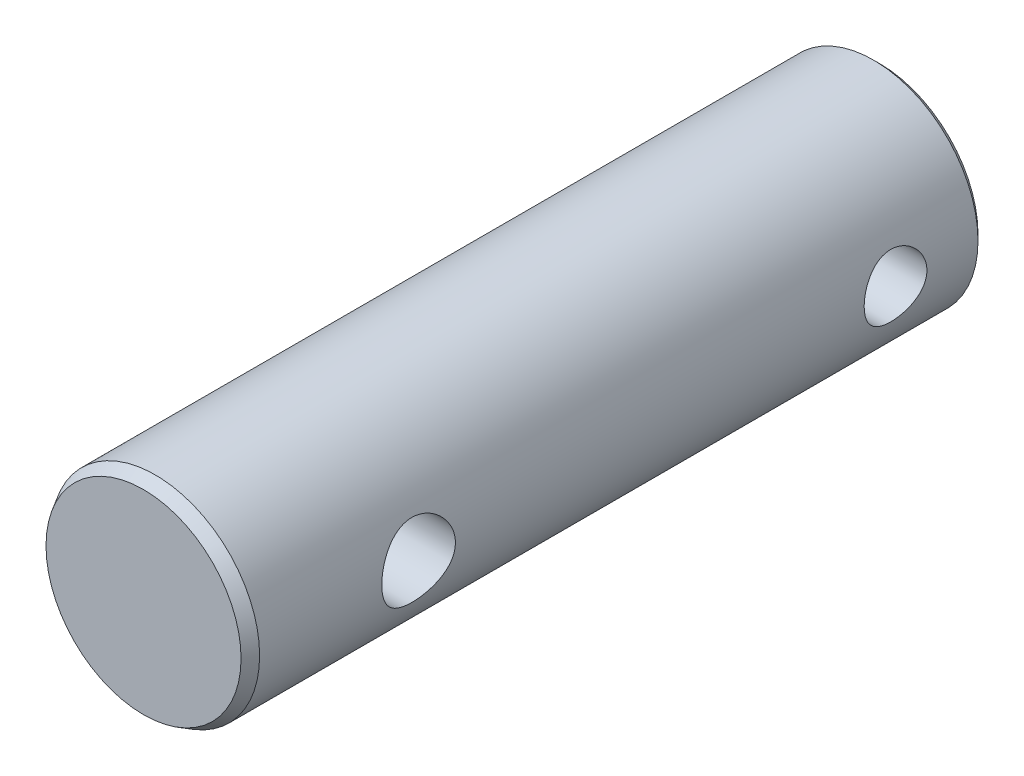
ISO-10303-21;
HEADER;
FILE_DESCRIPTION(('STEP AP214'),'2;1');
FILE_NAME('part.step','',(''),(''),'','','');
FILE_SCHEMA(('AUTOMOTIVE_DESIGN { 1 0 10303 214 1 1 1 1 }'));
ENDSEC;
DATA;
#1=APPLICATION_CONTEXT('core data for automotive mechanical design processes');
#2=APPLICATION_PROTOCOL_DEFINITION('international standard','automotive_design',2000,#1);
#3=PRODUCT_CONTEXT('',#1,'mechanical');
#4=PRODUCT('Part','Part','',(#3));
#5=PRODUCT_RELATED_PRODUCT_CATEGORY('part','',(#4));
#6=PRODUCT_DEFINITION_FORMATION('','',#4);
#7=PRODUCT_DEFINITION_CONTEXT('part definition',#1,'design');
#8=PRODUCT_DEFINITION('design','',#6,#7);
#9=PRODUCT_DEFINITION_SHAPE('','',#8);
#10=(LENGTH_UNIT() NAMED_UNIT(*) SI_UNIT(.MILLI.,.METRE.));
#11=(NAMED_UNIT(*) PLANE_ANGLE_UNIT() SI_UNIT($,.RADIAN.));
#12=(NAMED_UNIT(*) SI_UNIT($,.STERADIAN.) SOLID_ANGLE_UNIT());
#13=UNCERTAINTY_MEASURE_WITH_UNIT(LENGTH_MEASURE(1.E-05),#10,'distance_accuracy_value','');
#14=(GEOMETRIC_REPRESENTATION_CONTEXT(3) GLOBAL_UNCERTAINTY_ASSIGNED_CONTEXT((#13)) GLOBAL_UNIT_ASSIGNED_CONTEXT((#10,
#11,#12)) REPRESENTATION_CONTEXT('',''));
#15=CARTESIAN_POINT('',(0.,0.,0.));
#16=DIRECTION('',(0.,0.,1.));
#17=DIRECTION('',(1.,0.,0.));
#18=AXIS2_PLACEMENT_3D('',#15,#16,#17);
#19=CARTESIAN_POINT('',(0.,0.,15.2119852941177));
#20=DIRECTION('',(0.,0.,1.));
#21=DIRECTION('',(1.,0.,0.));
#22=AXIS2_PLACEMENT_3D('',#19,#20,#21);
#23=CYLINDRICAL_SURFACE('',#22,2.);
#24=CARTESIAN_POINT('',(0.,0.,0.254000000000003));
#25=DIRECTION('',(0.,0.,1.));
#26=DIRECTION('',(1.,0.,0.));
#27=AXIS2_PLACEMENT_3D('',#24,#25,#26);
#28=CIRCLE('',#27,2.);
#29=CARTESIAN_POINT('',(2.,0.,0.254000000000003));
#30=VERTEX_POINT('',#29);
#31=EDGE_CURVE('E114',#30,#30,#28,.F.);
#32=ORIENTED_EDGE('',*,*,#31,.T.);
#33=EDGE_LOOP('',(#32));
#34=FACE_BOUND('',#33,.T.);
#35=CARTESIAN_POINT('',(0.,0.,10.16));
#36=DIRECTION('',(0.,0.,1.));
#37=DIRECTION('',(1.,0.,0.));
#38=AXIS2_PLACEMENT_3D('',#35,#36,#37);
#39=CIRCLE('',#38,2.);
#40=CARTESIAN_POINT('',(2.,0.,10.16));
#41=VERTEX_POINT('',#40);
#42=EDGE_CURVE('E84',#41,#41,#39,.T.);
#43=ORIENTED_EDGE('',*,*,#42,.T.);
#44=EDGE_LOOP('',(#43));
#45=FACE_BOUND('',#44,.T.);
#46=CARTESIAN_POINT('',(2.,0.,2.45745));
#47=CARTESIAN_POINT('',(1.99999797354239,-0.067731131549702,2.45745209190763));
#48=CARTESIAN_POINT('',(1.99652812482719,-0.135481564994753,2.46256791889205));
#49=CARTESIAN_POINT('',(1.98298635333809,-0.268825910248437,2.48271686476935));
#50=CARTESIAN_POINT('',(1.97290933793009,-0.334418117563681,2.49775763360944));
#51=CARTESIAN_POINT('',(1.94714576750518,-0.461300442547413,2.53682208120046));
#52=CARTESIAN_POINT('',(1.93148661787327,-0.522609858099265,2.56080189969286));
#53=CARTESIAN_POINT('',(1.89580694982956,-0.64006978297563,2.61671123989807));
#54=CARTESIAN_POINT('',(1.87578598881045,-0.696219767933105,2.64864156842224));
#55=CARTESIAN_POINT('',(1.83092247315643,-0.807221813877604,2.72252317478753));
#56=CARTESIAN_POINT('',(1.80581342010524,-0.861547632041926,2.76509982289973));
#57=CARTESIAN_POINT('',(1.7539373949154,-0.96278078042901,2.85755396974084));
#58=CARTESIAN_POINT('',(1.72716804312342,-1.00967710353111,2.90744209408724));
#59=CARTESIAN_POINT('',(1.66968100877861,-1.10254490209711,3.02252515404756));
#60=CARTESIAN_POINT('',(1.63903102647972,-1.14711949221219,3.0888896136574));
#61=CARTESIAN_POINT('',(1.5820953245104,-1.22445066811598,3.22987210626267));
#62=CARTESIAN_POINT('',(1.55580212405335,-1.25722762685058,3.30447561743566));
#63=CARTESIAN_POINT('',(1.5187047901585,-1.30158113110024,3.4376533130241));
#64=CARTESIAN_POINT('',(1.50561956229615,-1.31656015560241,3.49445207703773));
#65=CARTESIAN_POINT('',(1.48564756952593,-1.33906047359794,3.61052838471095));
#66=CARTESIAN_POINT('',(1.47874981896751,-1.34659498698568,3.66980133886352));
#67=CARTESIAN_POINT('',(1.47222521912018,-1.35372839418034,3.78951358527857));
#68=CARTESIAN_POINT('',(1.47263145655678,-1.3532911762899,3.84995694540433));
#69=CARTESIAN_POINT('',(1.48072695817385,-1.34442527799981,3.96977274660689));
#70=CARTESIAN_POINT('',(1.48842152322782,-1.33599078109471,4.02914437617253));
#71=CARTESIAN_POINT('',(1.50931979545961,-1.31231970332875,4.1422408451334));
#72=CARTESIAN_POINT('',(1.52222822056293,-1.29744502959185,4.19609956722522));
#73=CARTESIAN_POINT('',(1.55202527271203,-1.26164962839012,4.30059909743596));
#74=CARTESIAN_POINT('',(1.56891696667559,-1.24072423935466,4.35123738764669));
#75=CARTESIAN_POINT('',(1.6139678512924,-1.18196930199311,4.47242680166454));
#76=CARTESIAN_POINT('',(1.64363714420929,-1.1408511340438,4.5408316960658));
#77=CARTESIAN_POINT('',(1.7045324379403,-1.04770100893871,4.66907571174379));
#78=CARTESIAN_POINT('',(1.7357612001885,-0.995649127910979,4.72889885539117));
#79=CARTESIAN_POINT('',(1.79673656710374,-0.880906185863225,4.8394610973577));
#80=CARTESIAN_POINT('',(1.82646898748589,-0.818131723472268,4.89012203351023));
#81=CARTESIAN_POINT('',(1.88110736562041,-0.683160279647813,4.98014204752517));
#82=CARTESIAN_POINT('',(1.90602322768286,-0.610983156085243,5.01952439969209));
#83=CARTESIAN_POINT('',(1.94358635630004,-0.475666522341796,5.07779136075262));
#84=CARTESIAN_POINT('',(1.95772852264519,-0.414063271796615,5.09928362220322));
#85=CARTESIAN_POINT('',(1.98028226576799,-0.287414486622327,5.13328120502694));
#86=CARTESIAN_POINT('',(1.9886976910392,-0.222371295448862,5.14579256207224));
#87=CARTESIAN_POINT('',(1.99905416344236,-0.0904148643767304,5.16116312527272));
#88=CARTESIAN_POINT('',(2.00097413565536,-0.0234962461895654,5.16399091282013));
#89=CARTESIAN_POINT('',(1.99809298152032,0.109880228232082,5.15972945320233));
#90=CARTESIAN_POINT('',(1.99329141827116,0.176338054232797,5.15263956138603));
#91=CARTESIAN_POINT('',(1.97783691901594,0.303401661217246,5.12958256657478));
#92=CARTESIAN_POINT('',(1.96749490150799,0.364133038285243,5.11408665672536));
#93=CARTESIAN_POINT('',(1.94199743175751,0.481957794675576,5.07528998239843));
#94=CARTESIAN_POINT('',(1.926841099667,0.539050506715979,5.05198779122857));
#95=CARTESIAN_POINT('',(1.89136310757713,0.653148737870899,4.99623222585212));
#96=CARTESIAN_POINT('',(1.87071922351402,0.709761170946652,4.96318398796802));
#97=CARTESIAN_POINT('',(1.82648464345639,0.816896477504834,4.88994888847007));
#98=CARTESIAN_POINT('',(1.80289163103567,0.867414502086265,4.8497564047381));
#99=CARTESIAN_POINT('',(1.75025015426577,0.969773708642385,4.7557965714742));
#100=CARTESIAN_POINT('',(1.72094756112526,1.02043373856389,4.70088322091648));
#101=CARTESIAN_POINT('',(1.66308093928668,1.11225262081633,4.58321260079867));
#102=CARTESIAN_POINT('',(1.63451718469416,1.15340799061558,4.5204524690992));
#103=CARTESIAN_POINT('',(1.58522226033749,1.22005355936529,4.39737974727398));
#104=CARTESIAN_POINT('',(1.56395644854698,1.24695396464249,4.33804917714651));
#105=CARTESIAN_POINT('',(1.52674356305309,1.292253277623,4.21468479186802));
#106=CARTESIAN_POINT('',(1.51078608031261,1.31066885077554,4.1506604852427));
#107=CARTESIAN_POINT('',(1.48857159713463,1.33581191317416,4.02953441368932));
#108=CARTESIAN_POINT('',(1.48118147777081,1.34392488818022,3.97293378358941));
#109=CARTESIAN_POINT('',(1.4730059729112,1.35288368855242,3.85870156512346));
#110=CARTESIAN_POINT('',(1.47221521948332,1.35373542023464,3.80107085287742));
#111=CARTESIAN_POINT('',(1.47735450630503,1.34812291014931,3.68653741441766));
#112=CARTESIAN_POINT('',(1.48327875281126,1.34166497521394,3.62963410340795));
#113=CARTESIAN_POINT('',(1.5009484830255,1.32186422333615,3.51794845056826));
#114=CARTESIAN_POINT('',(1.51270203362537,1.30851186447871,3.46316916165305));
#115=CARTESIAN_POINT('',(1.54513730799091,1.27018257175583,3.33937668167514));
#116=CARTESIAN_POINT('',(1.56748012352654,1.2428359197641,3.27153866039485));
#117=CARTESIAN_POINT('',(1.61642521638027,1.1784750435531,3.14230244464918));
#118=CARTESIAN_POINT('',(1.64303385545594,1.14144632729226,3.08091409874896));
#119=CARTESIAN_POINT('',(1.69813751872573,1.05777508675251,2.96396910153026));
#120=CARTESIAN_POINT('',(1.72665913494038,1.0109598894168,2.90854879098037));
#121=CARTESIAN_POINT('',(1.78258034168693,0.908737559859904,2.80558455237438));
#122=CARTESIAN_POINT('',(1.80997963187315,0.853328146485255,2.75804272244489));
#123=CARTESIAN_POINT('',(1.86435453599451,0.727596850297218,2.66689157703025));
#124=CARTESIAN_POINT('',(1.89091535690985,0.65629164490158,2.62437144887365));
#125=CARTESIAN_POINT('',(1.93673795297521,0.505203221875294,2.55257802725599));
#126=CARTESIAN_POINT('',(1.95601632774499,0.425439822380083,2.52327457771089));
#127=CARTESIAN_POINT('',(1.9800364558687,0.287464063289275,2.48710632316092));
#128=CARTESIAN_POINT('',(1.9874741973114,0.230797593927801,2.47603078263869));
#129=CARTESIAN_POINT('',(1.99745588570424,0.116091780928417,2.46120314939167));
#130=CARTESIAN_POINT('',(2.00000173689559,0.058052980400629,2.45744820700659));
#131=CARTESIAN_POINT('',(2.,0.,2.45745));
#132=B_SPLINE_CURVE_WITH_KNOTS('',3,(#46,#47,#48,#49,#50,#51,#52,#53,#54,#55,#56,#57,#58,#59,
#60,#61,#62,#63,#64,#65,#66,#67,#68,#69,#70,#71,#72,#73,#74,#75,#76,#77,#78,#79,#80,#81,#82,#83,
#84,#85,#86,#87,#88,#89,#90,#91,#92,#93,#94,#95,#96,#97,#98,#99,#100,#101,#102,#103,#104,#105,
#106,#107,#108,#109,#110,#111,#112,#113,#114,#115,#116,#117,#118,#119,#120,#121,#122,#123,#124,
#125,#126,#127,#128,#129,#130,#131),.UNSPECIFIED.,.T.,.F.,(4,2,2,2,2,2,2,2,2,2,2,2,2,2,2,2,2,2,
2,2,2,2,2,2,2,2,2,2,2,2,2,2,2,2,2,2,2,2,2,2,2,2,4),(0.,0.202956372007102,0.406069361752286,
0.608198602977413,0.810348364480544,1.02987075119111,1.24971538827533,1.50539669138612,
1.76063432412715,1.9404702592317,2.11998626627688,2.30031567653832,2.48077634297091,
2.65219706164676,2.82375019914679,3.07787145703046,3.33245986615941,3.58912705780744,
3.84526071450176,4.04469518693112,4.24399550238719,4.44394184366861,4.64390118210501,
4.83366229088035,5.02345809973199,5.22885817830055,5.43442061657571,5.67422225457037,
5.914111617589,6.11895348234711,6.32339127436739,6.49558028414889,6.66762922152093,
6.83952982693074,7.01166898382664,7.23987497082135,7.46842450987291,7.70141074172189,
7.93445892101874,8.19443606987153,8.45381699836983,8.62784054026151,8.80179632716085),.UNSPECIFIED.);
#133=CARTESIAN_POINT('',(2.,0.,2.45745));
#134=VERTEX_POINT('',#133);
#135=EDGE_CURVE('E77',#134,#134,#132,.T.);
#136=ORIENTED_EDGE('',*,*,#135,.F.);
#137=EDGE_LOOP('',(#136));
#138=FACE_BOUND('',#137,.T.);
#139=ADVANCED_FACE('F36',(#34,#45,#138),#23,.F.);
#140=CARTESIAN_POINT('',(0.,0.,15.2119852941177));
#141=DIRECTION('',(0.,0.,1.));
#142=DIRECTION('',(1.,0.,0.));
#143=AXIS2_PLACEMENT_3D('',#140,#141,#142);
#144=CYLINDRICAL_SURFACE('',#143,4.5);
#145=CARTESIAN_POINT('',(-4.5,0.,22.7965));
#146=CARTESIAN_POINT('',(-4.50000107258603,0.0863260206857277,22.7964984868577));
#147=CARTESIAN_POINT('',(-4.49749360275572,0.172641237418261,22.8035639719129));
#148=CARTESIAN_POINT('',(-4.48773934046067,0.342711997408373,22.831540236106));
#149=CARTESIAN_POINT('',(-4.48049260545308,0.42646757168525,22.8524508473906));
#150=CARTESIAN_POINT('',(-4.46204294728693,0.588942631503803,22.9072993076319));
#151=CARTESIAN_POINT('',(-4.45084710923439,0.667670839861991,22.9412138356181));
#152=CARTESIAN_POINT('',(-4.42562930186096,0.818319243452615,23.020995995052));
#153=CARTESIAN_POINT('',(-4.41160667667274,0.890237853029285,23.0668664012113));
#154=CARTESIAN_POINT('',(-4.3815987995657,1.02797575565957,23.1710960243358));
#155=CARTESIAN_POINT('',(-4.36556255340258,1.09349930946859,23.229831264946));
#156=CARTESIAN_POINT('',(-4.33360156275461,1.2139979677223,23.3573245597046));
#157=CARTESIAN_POINT('',(-4.31767684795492,1.26897035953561,23.4260851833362));
#158=CARTESIAN_POINT('',(-4.28716654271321,1.36858030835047,23.5744421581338));
#159=CARTESIAN_POINT('',(-4.27264223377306,1.41281842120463,23.6543205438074));
#160=CARTESIAN_POINT('',(-4.24736081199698,1.48710366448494,23.8209780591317));
#161=CARTESIAN_POINT('',(-4.23660239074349,1.51715572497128,23.9077547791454));
#162=CARTESIAN_POINT('',(-4.22061149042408,1.56107976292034,24.0823615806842));
#163=CARTESIAN_POINT('',(-4.21518874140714,1.57551085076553,24.1700330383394));
#164=CARTESIAN_POINT('',(-4.2099228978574,1.58953162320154,24.3467078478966));
#165=CARTESIAN_POINT('',(-4.21007782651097,1.58912656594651,24.4357107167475));
#166=CARTESIAN_POINT('',(-4.21578430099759,1.57391762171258,24.6076019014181));
#167=CARTESIAN_POINT('',(-4.22105486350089,1.55986340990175,24.6905675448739));
#168=CARTESIAN_POINT('',(-4.23593570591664,1.51898548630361,24.8528771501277));
#169=CARTESIAN_POINT('',(-4.2455465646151,1.49216007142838,24.9322206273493));
#170=CARTESIAN_POINT('',(-4.26821093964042,1.42604713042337,25.0866566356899));
#171=CARTESIAN_POINT('',(-4.28132162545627,1.38655022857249,25.1616507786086));
#172=CARTESIAN_POINT('',(-4.30948668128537,1.29636099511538,25.3041749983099));
#173=CARTESIAN_POINT('',(-4.32454166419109,1.24566512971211,25.3717027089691));
#174=CARTESIAN_POINT('',(-4.35598264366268,1.13099397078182,25.5015623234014));
#175=CARTESIAN_POINT('',(-4.37239479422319,1.06641216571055,25.5633535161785));
#176=CARTESIAN_POINT('',(-4.4039308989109,0.927605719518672,25.675378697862));
#177=CARTESIAN_POINT('',(-4.41905469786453,0.853379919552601,25.7256112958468));
#178=CARTESIAN_POINT('',(-4.4465521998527,0.696140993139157,25.8135998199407));
#179=CARTESIAN_POINT('',(-4.45888986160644,0.613031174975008,25.8511950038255));
#180=CARTESIAN_POINT('',(-4.47916106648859,0.441125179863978,25.9116972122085));
#181=CARTESIAN_POINT('',(-4.4870963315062,0.352331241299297,25.934609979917));
#182=CARTESIAN_POINT('',(-4.49737546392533,0.176142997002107,25.9641022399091));
#183=CARTESIAN_POINT('',(-4.49996883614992,0.0888852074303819,25.9714111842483));
#184=CARTESIAN_POINT('',(-4.5000305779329,-0.0856373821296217,25.971587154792));
#185=CARTESIAN_POINT('',(-4.49749993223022,-0.172902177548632,25.9644569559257));
#186=CARTESIAN_POINT('',(-4.48776289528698,-0.341937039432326,25.936524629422));
#187=CARTESIAN_POINT('',(-4.48071437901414,-0.423793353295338,25.9161838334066));
#188=CARTESIAN_POINT('',(-4.46280802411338,-0.582887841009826,25.8629983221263));
#189=CARTESIAN_POINT('',(-4.45194969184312,-0.660125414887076,25.8301519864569));
#190=CARTESIAN_POINT('',(-4.42713575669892,-0.810196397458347,25.7518814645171));
#191=CARTESIAN_POINT('',(-4.41310222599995,-0.882846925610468,25.7061320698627));
#192=CARTESIAN_POINT('',(-4.38351264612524,-1.01966898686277,25.6037290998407));
#193=CARTESIAN_POINT('',(-4.36795608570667,-1.08383765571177,25.5470718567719));
#194=CARTESIAN_POINT('',(-4.33605799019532,-1.20529955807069,25.42104056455));
#195=CARTESIAN_POINT('',(-4.31971701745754,-1.26207301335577,25.3511641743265));
#196=CARTESIAN_POINT('',(-4.2888891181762,-1.36316990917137,25.2025358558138));
#197=CARTESIAN_POINT('',(-4.27440226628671,-1.40749284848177,25.1237835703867));
#198=CARTESIAN_POINT('',(-4.24903422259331,-1.48232209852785,24.9593569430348));
#199=CARTESIAN_POINT('',(-4.23815452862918,-1.51282267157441,24.8736797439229));
#200=CARTESIAN_POINT('',(-4.22146446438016,-1.55879684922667,24.6979237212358));
#201=CARTESIAN_POINT('',(-4.21565143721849,-1.57427833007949,24.6078472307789));
#202=CARTESIAN_POINT('',(-4.21007865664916,-1.58911745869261,24.4314072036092));
#203=CARTESIAN_POINT('',(-4.20999107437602,-1.58934833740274,24.3451267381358));
#204=CARTESIAN_POINT('',(-4.21505487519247,-1.57586899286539,24.1738265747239));
#205=CARTESIAN_POINT('',(-4.22020587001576,-1.56215980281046,24.088806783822));
#206=CARTESIAN_POINT('',(-4.2349086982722,-1.52183733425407,23.9244809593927));
#207=CARTESIAN_POINT('',(-4.24435255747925,-1.49553986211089,23.8450869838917));
#208=CARTESIAN_POINT('',(-4.26652620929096,-1.43105245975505,23.6917824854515));
#209=CARTESIAN_POINT('',(-4.27925678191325,-1.392859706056,23.6178732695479));
#210=CARTESIAN_POINT('',(-4.30732754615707,-1.30354043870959,23.4738013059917));
#211=CARTESIAN_POINT('',(-4.32276339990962,-1.25188289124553,23.4039865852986));
#212=CARTESIAN_POINT('',(-4.35413903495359,-1.13796315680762,23.2737357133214));
#213=CARTESIAN_POINT('',(-4.37007896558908,-1.0756978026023,23.2133023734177));
#214=CARTESIAN_POINT('',(-4.40153989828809,-0.938926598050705,23.1007357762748));
#215=CARTESIAN_POINT('',(-4.41700863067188,-0.863991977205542,23.0491068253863));
#216=CARTESIAN_POINT('',(-4.44499939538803,-0.705980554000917,22.9592172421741));
#217=CARTESIAN_POINT('',(-4.45752175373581,-0.622904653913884,22.9209551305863));
#218=CARTESIAN_POINT('',(-4.47813672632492,-0.451342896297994,22.8593003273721));
#219=CARTESIAN_POINT('',(-4.48625133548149,-0.362886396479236,22.8358337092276));
#220=CARTESIAN_POINT('',(-4.49718143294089,-0.182948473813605,22.8044371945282));
#221=CARTESIAN_POINT('',(-4.49999886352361,-0.0914681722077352,22.7965016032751));
#222=CARTESIAN_POINT('',(-4.5,0.,22.7965));
#223=B_SPLINE_CURVE_WITH_KNOTS('',3,(#145,#146,#147,#148,#149,#150,#151,#152,#153,#154,#155,
#156,#157,#158,#159,#160,#161,#162,#163,#164,#165,#166,#167,#168,#169,#170,#171,#172,#173,#174,
#175,#176,#177,#178,#179,#180,#181,#182,#183,#184,#185,#186,#187,#188,#189,#190,#191,#192,#193,
#194,#195,#196,#197,#198,#199,#200,#201,#202,#203,#204,#205,#206,#207,#208,#209,#210,#211,#212,
#213,#214,#215,#216,#217,#218,#219,#220,#221,#222),.UNSPECIFIED.,.T.,.F.,(4,2,2,2,2,2,2,2,2,2,2,
2,2,2,2,2,2,2,2,2,2,2,2,2,2,2,2,2,2,2,2,2,2,2,2,2,2,2,4),(0.,0.25864109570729,0.517279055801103,
0.775455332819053,1.03369158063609,1.30083024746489,1.56803750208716,1.84403444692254,
2.11993540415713,2.38559661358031,2.6511636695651,2.90292416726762,3.15471824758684,
3.41090788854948,3.66717848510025,3.93855141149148,4.20995697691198,4.48469448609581,
4.75932446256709,5.02080627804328,5.2822378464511,5.53499793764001,5.78779079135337,
6.04763313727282,6.30756300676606,6.58079242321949,6.85403283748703,7.12738657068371,
7.40059687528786,7.65814907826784,7.91568219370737,8.16706847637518,8.41851447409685,
8.6819813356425,8.94552700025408,9.22109339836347,9.4966292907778,9.77077730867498,
10.044824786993),.UNSPECIFIED.);
#224=CARTESIAN_POINT('',(-4.5,0.,22.7965));
#225=VERTEX_POINT('',#224);
#226=EDGE_CURVE('E11',#225,#225,#223,.T.);
#227=ORIENTED_EDGE('',*,*,#226,.T.);
#228=EDGE_LOOP('',(#227));
#229=FACE_BOUND('',#228,.T.);
#230=CARTESIAN_POINT('',(4.5,0.,22.7965));
#231=CARTESIAN_POINT('',(4.50000107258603,-0.0863260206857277,22.7964984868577));
#232=CARTESIAN_POINT('',(4.49749360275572,-0.172641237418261,22.8035639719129));
#233=CARTESIAN_POINT('',(4.48773934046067,-0.342711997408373,22.831540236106));
#234=CARTESIAN_POINT('',(4.48049260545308,-0.42646757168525,22.8524508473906));
#235=CARTESIAN_POINT('',(4.46204294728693,-0.588942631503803,22.9072993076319));
#236=CARTESIAN_POINT('',(4.45084710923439,-0.667670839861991,22.9412138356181));
#237=CARTESIAN_POINT('',(4.42562930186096,-0.818319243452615,23.020995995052));
#238=CARTESIAN_POINT('',(4.41160667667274,-0.890237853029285,23.0668664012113));
#239=CARTESIAN_POINT('',(4.3815987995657,-1.02797575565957,23.1710960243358));
#240=CARTESIAN_POINT('',(4.36556255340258,-1.09349930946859,23.229831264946));
#241=CARTESIAN_POINT('',(4.33360156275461,-1.2139979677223,23.3573245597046));
#242=CARTESIAN_POINT('',(4.31767684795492,-1.26897035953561,23.4260851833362));
#243=CARTESIAN_POINT('',(4.28716654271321,-1.36858030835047,23.5744421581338));
#244=CARTESIAN_POINT('',(4.27264223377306,-1.41281842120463,23.6543205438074));
#245=CARTESIAN_POINT('',(4.24736081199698,-1.48710366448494,23.8209780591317));
#246=CARTESIAN_POINT('',(4.23660239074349,-1.51715572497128,23.9077547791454));
#247=CARTESIAN_POINT('',(4.22061149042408,-1.56107976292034,24.0823615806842));
#248=CARTESIAN_POINT('',(4.21518874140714,-1.57551085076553,24.1700330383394));
#249=CARTESIAN_POINT('',(4.2099228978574,-1.58953162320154,24.3467078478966));
#250=CARTESIAN_POINT('',(4.21007782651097,-1.58912656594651,24.4357107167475));
#251=CARTESIAN_POINT('',(4.21578430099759,-1.57391762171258,24.6076019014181));
#252=CARTESIAN_POINT('',(4.22105486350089,-1.55986340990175,24.6905675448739));
#253=CARTESIAN_POINT('',(4.23593570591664,-1.51898548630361,24.8528771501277));
#254=CARTESIAN_POINT('',(4.2455465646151,-1.49216007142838,24.9322206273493));
#255=CARTESIAN_POINT('',(4.26821093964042,-1.42604713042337,25.0866566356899));
#256=CARTESIAN_POINT('',(4.28132162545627,-1.38655022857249,25.1616507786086));
#257=CARTESIAN_POINT('',(4.30948668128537,-1.29636099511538,25.3041749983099));
#258=CARTESIAN_POINT('',(4.32454166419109,-1.24566512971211,25.3717027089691));
#259=CARTESIAN_POINT('',(4.35598264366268,-1.13099397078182,25.5015623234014));
#260=CARTESIAN_POINT('',(4.37239479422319,-1.06641216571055,25.5633535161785));
#261=CARTESIAN_POINT('',(4.4039308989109,-0.927605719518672,25.675378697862));
#262=CARTESIAN_POINT('',(4.41905469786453,-0.853379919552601,25.7256112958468));
#263=CARTESIAN_POINT('',(4.4465521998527,-0.696140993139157,25.8135998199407));
#264=CARTESIAN_POINT('',(4.45888986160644,-0.613031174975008,25.8511950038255));
#265=CARTESIAN_POINT('',(4.47916106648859,-0.441125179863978,25.9116972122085));
#266=CARTESIAN_POINT('',(4.4870963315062,-0.352331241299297,25.934609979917));
#267=CARTESIAN_POINT('',(4.49737546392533,-0.176142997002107,25.9641022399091));
#268=CARTESIAN_POINT('',(4.49996883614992,-0.0888852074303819,25.9714111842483));
#269=CARTESIAN_POINT('',(4.5000305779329,0.0856373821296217,25.971587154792));
#270=CARTESIAN_POINT('',(4.49749993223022,0.172902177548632,25.9644569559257));
#271=CARTESIAN_POINT('',(4.48776289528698,0.341937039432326,25.936524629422));
#272=CARTESIAN_POINT('',(4.48071437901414,0.423793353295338,25.9161838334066));
#273=CARTESIAN_POINT('',(4.46280802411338,0.582887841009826,25.8629983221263));
#274=CARTESIAN_POINT('',(4.45194969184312,0.660125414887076,25.8301519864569));
#275=CARTESIAN_POINT('',(4.42713575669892,0.810196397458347,25.7518814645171));
#276=CARTESIAN_POINT('',(4.41310222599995,0.882846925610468,25.7061320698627));
#277=CARTESIAN_POINT('',(4.38351264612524,1.01966898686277,25.6037290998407));
#278=CARTESIAN_POINT('',(4.36795608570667,1.08383765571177,25.5470718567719));
#279=CARTESIAN_POINT('',(4.33605799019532,1.20529955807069,25.42104056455));
#280=CARTESIAN_POINT('',(4.31971701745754,1.26207301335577,25.3511641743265));
#281=CARTESIAN_POINT('',(4.2888891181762,1.36316990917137,25.2025358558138));
#282=CARTESIAN_POINT('',(4.27440226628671,1.40749284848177,25.1237835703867));
#283=CARTESIAN_POINT('',(4.24903422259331,1.48232209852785,24.9593569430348));
#284=CARTESIAN_POINT('',(4.23815452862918,1.51282267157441,24.8736797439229));
#285=CARTESIAN_POINT('',(4.22146446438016,1.55879684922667,24.6979237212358));
#286=CARTESIAN_POINT('',(4.21565143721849,1.57427833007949,24.6078472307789));
#287=CARTESIAN_POINT('',(4.21007865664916,1.58911745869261,24.4314072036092));
#288=CARTESIAN_POINT('',(4.20999107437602,1.58934833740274,24.3451267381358));
#289=CARTESIAN_POINT('',(4.21505487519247,1.57586899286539,24.1738265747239));
#290=CARTESIAN_POINT('',(4.22020587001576,1.56215980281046,24.088806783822));
#291=CARTESIAN_POINT('',(4.2349086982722,1.52183733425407,23.9244809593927));
#292=CARTESIAN_POINT('',(4.24435255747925,1.49553986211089,23.8450869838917));
#293=CARTESIAN_POINT('',(4.26652620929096,1.43105245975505,23.6917824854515));
#294=CARTESIAN_POINT('',(4.27925678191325,1.392859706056,23.6178732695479));
#295=CARTESIAN_POINT('',(4.30732754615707,1.30354043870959,23.4738013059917));
#296=CARTESIAN_POINT('',(4.32276339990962,1.25188289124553,23.4039865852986));
#297=CARTESIAN_POINT('',(4.35413903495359,1.13796315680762,23.2737357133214));
#298=CARTESIAN_POINT('',(4.37007896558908,1.0756978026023,23.2133023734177));
#299=CARTESIAN_POINT('',(4.40153989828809,0.938926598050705,23.1007357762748));
#300=CARTESIAN_POINT('',(4.41700863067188,0.863991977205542,23.0491068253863));
#301=CARTESIAN_POINT('',(4.44499939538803,0.705980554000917,22.9592172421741));
#302=CARTESIAN_POINT('',(4.45752175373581,0.622904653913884,22.9209551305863));
#303=CARTESIAN_POINT('',(4.47813672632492,0.451342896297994,22.8593003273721));
#304=CARTESIAN_POINT('',(4.48625133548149,0.362886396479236,22.8358337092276));
#305=CARTESIAN_POINT('',(4.49718143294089,0.182948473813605,22.8044371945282));
#306=CARTESIAN_POINT('',(4.49999886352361,0.0914681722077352,22.7965016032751));
#307=CARTESIAN_POINT('',(4.5,0.,22.7965));
#308=B_SPLINE_CURVE_WITH_KNOTS('',3,(#230,#231,#232,#233,#234,#235,#236,#237,#238,#239,#240,
#241,#242,#243,#244,#245,#246,#247,#248,#249,#250,#251,#252,#253,#254,#255,#256,#257,#258,#259,
#260,#261,#262,#263,#264,#265,#266,#267,#268,#269,#270,#271,#272,#273,#274,#275,#276,#277,#278,
#279,#280,#281,#282,#283,#284,#285,#286,#287,#288,#289,#290,#291,#292,#293,#294,#295,#296,#297,
#298,#299,#300,#301,#302,#303,#304,#305,#306,#307),.UNSPECIFIED.,.T.,.F.,(4,2,2,2,2,2,2,2,2,2,2,
2,2,2,2,2,2,2,2,2,2,2,2,2,2,2,2,2,2,2,2,2,2,2,2,2,2,2,4),(0.,0.25864109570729,0.517279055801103,
0.775455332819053,1.03369158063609,1.30083024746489,1.56803750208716,1.84403444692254,
2.11993540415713,2.38559661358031,2.6511636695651,2.90292416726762,3.15471824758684,
3.41090788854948,3.66717848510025,3.93855141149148,4.20995697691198,4.48469448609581,
4.75932446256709,5.02080627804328,5.2822378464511,5.53499793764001,5.78779079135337,
6.04763313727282,6.30756300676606,6.58079242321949,6.85403283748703,7.12738657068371,
7.40059687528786,7.65814907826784,7.91568219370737,8.16706847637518,8.41851447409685,
8.6819813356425,8.94552700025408,9.22109339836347,9.4966292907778,9.77077730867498,
10.044824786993),.UNSPECIFIED.);
#309=CARTESIAN_POINT('',(4.5,0.,22.7965));
#310=VERTEX_POINT('',#309);
#311=EDGE_CURVE('E48',#310,#310,#308,.T.);
#312=ORIENTED_EDGE('',*,*,#311,.T.);
#313=EDGE_LOOP('',(#312));
#314=FACE_BOUND('',#313,.T.);
#315=CARTESIAN_POINT('',(0.,0.,0.253999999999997));
#316=DIRECTION('',(0.,0.,1.));
#317=DIRECTION('',(1.,0.,0.));
#318=AXIS2_PLACEMENT_3D('',#315,#316,#317);
#319=CIRCLE('',#318,4.5);
#320=CARTESIAN_POINT('',(4.5,0.,0.253999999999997));
#321=VERTEX_POINT('',#320);
#322=EDGE_CURVE('E103',#321,#321,#319,.T.);
#323=ORIENTED_EDGE('',*,*,#322,.T.);
#324=EDGE_LOOP('',(#323));
#325=FACE_BOUND('',#324,.T.);
#326=CARTESIAN_POINT('',(0.,0.,31.242));
#327=DIRECTION('',(0.,0.,-1.));
#328=DIRECTION('',(-1.,0.,0.));
#329=AXIS2_PLACEMENT_3D('',#326,#327,#328);
#330=CIRCLE('',#329,4.5);
#331=CARTESIAN_POINT('',(-4.5,0.,31.242));
#332=VERTEX_POINT('',#331);
#333=EDGE_CURVE('E104',#332,#332,#330,.T.);
#334=ORIENTED_EDGE('',*,*,#333,.T.);
#335=EDGE_LOOP('',(#334));
#336=FACE_BOUND('',#335,.T.);
#337=CARTESIAN_POINT('',(4.5,0.,5.16255));
#338=CARTESIAN_POINT('',(4.49999937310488,-0.0741931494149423,5.16254911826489));
#339=CARTESIAN_POINT('',(4.49814759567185,-0.148395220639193,5.15642505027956));
#340=CARTESIAN_POINT('',(4.49094142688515,-0.29463812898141,5.13214900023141));
#341=CARTESIAN_POINT('',(4.48558600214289,-0.366678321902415,5.11399346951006));
#342=CARTESIAN_POINT('',(4.47195926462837,-0.506467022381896,5.06631573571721));
#343=CARTESIAN_POINT('',(4.46369226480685,-0.574221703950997,5.03681033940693));
#344=CARTESIAN_POINT('',(4.44510138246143,-0.703822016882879,4.96733945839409));
#345=CARTESIAN_POINT('',(4.43477722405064,-0.765666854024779,4.92737257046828));
#346=CARTESIAN_POINT('',(4.41284044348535,-0.883473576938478,4.83690014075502));
#347=CARTESIAN_POINT('',(4.40120134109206,-0.93924119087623,4.78614806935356));
#348=CARTESIAN_POINT('',(4.37810423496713,-1.04161559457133,4.67607135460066));
#349=CARTESIAN_POINT('',(4.36664626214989,-1.08822083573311,4.61674526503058));
#350=CARTESIAN_POINT('',(4.34492838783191,-1.17197126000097,4.48955904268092));
#351=CARTESIAN_POINT('',(4.33470138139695,-1.20887906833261,4.42153645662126));
#352=CARTESIAN_POINT('',(4.31699925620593,-1.27065235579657,4.27989311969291));
#353=CARTESIAN_POINT('',(4.30952347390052,-1.29552073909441,4.20627372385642));
#354=CARTESIAN_POINT('',(4.29844623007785,-1.33180825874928,4.05770851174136));
#355=CARTESIAN_POINT('',(4.29474181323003,-1.34358564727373,3.98285808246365));
#356=CARTESIAN_POINT('',(4.291320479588,-1.35447556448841,3.83215911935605));
#357=CARTESIAN_POINT('',(4.29160259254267,-1.35359117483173,3.75631083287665));
#358=CARTESIAN_POINT('',(4.29603121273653,-1.33946397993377,3.60868481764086));
#359=CARTESIAN_POINT('',(4.3000372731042,-1.32667030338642,3.53685919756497));
#360=CARTESIAN_POINT('',(4.31123514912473,-1.28981345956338,3.39642490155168));
#361=CARTESIAN_POINT('',(4.31842728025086,-1.26574917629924,3.32781654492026));
#362=CARTESIAN_POINT('',(4.33529881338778,-1.20670400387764,3.19466702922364));
#363=CARTESIAN_POINT('',(4.34501103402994,-1.17157765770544,3.13019470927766));
#364=CARTESIAN_POINT('',(4.36581268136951,-1.091506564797,3.00790927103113));
#365=CARTESIAN_POINT('',(4.37690244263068,-1.04655943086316,2.95009777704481));
#366=CARTESIAN_POINT('',(4.39977895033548,-0.945893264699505,2.84022806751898));
#367=CARTESIAN_POINT('',(4.41157542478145,-0.889801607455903,2.78851269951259));
#368=CARTESIAN_POINT('',(4.43412425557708,-0.769595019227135,2.6951425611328));
#369=CARTESIAN_POINT('',(4.4448765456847,-0.705479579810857,2.65348842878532));
#370=CARTESIAN_POINT('',(4.46422435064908,-0.570420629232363,2.58121391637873));
#371=CARTESIAN_POINT('',(4.47280482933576,-0.499433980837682,2.55066985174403));
#372=CARTESIAN_POINT('',(4.48673385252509,-0.353013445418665,2.50205544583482));
#373=CARTESIAN_POINT('',(4.49208330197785,-0.277580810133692,2.48398161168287));
#374=CARTESIAN_POINT('',(4.49880428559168,-0.127323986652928,2.46139209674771));
#375=CARTESIAN_POINT('',(4.50031208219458,-0.0525756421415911,2.4564117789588));
#376=CARTESIAN_POINT('',(4.49957978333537,0.0966937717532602,2.45884801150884));
#377=CARTESIAN_POINT('',(4.49734019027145,0.171214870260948,2.46626290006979));
#378=CARTESIAN_POINT('',(4.48945396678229,0.316158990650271,2.49290349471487));
#379=CARTESIAN_POINT('',(4.48388577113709,0.386636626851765,2.51185747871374));
#380=CARTESIAN_POINT('',(4.46998718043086,0.52339588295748,2.56071110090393));
#381=CARTESIAN_POINT('',(4.4616564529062,0.589676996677,2.59061205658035));
#382=CARTESIAN_POINT('',(4.4428550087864,0.717869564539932,2.66128937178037));
#383=CARTESIAN_POINT('',(4.43233914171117,0.779644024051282,2.70230187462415));
#384=CARTESIAN_POINT('',(4.41037447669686,0.895592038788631,2.79375129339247));
#385=CARTESIAN_POINT('',(4.39892544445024,0.949763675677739,2.84419058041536));
#386=CARTESIAN_POINT('',(4.37586150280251,1.05101562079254,2.95524485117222));
#387=CARTESIAN_POINT('',(4.36425576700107,1.09776533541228,3.0161638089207));
#388=CARTESIAN_POINT('',(4.34263539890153,1.18040196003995,3.14523419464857));
#389=CARTESIAN_POINT('',(4.33262072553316,1.21628915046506,3.21338543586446));
#390=CARTESIAN_POINT('',(4.31543144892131,1.27593747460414,3.35477208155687));
#391=CARTESIAN_POINT('',(4.30824373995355,1.29975471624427,3.42798212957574));
#392=CARTESIAN_POINT('',(4.29756279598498,1.33465107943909,3.57763027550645));
#393=CARTESIAN_POINT('',(4.29406828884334,1.34573458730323,3.65406725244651));
#394=CARTESIAN_POINT('',(4.29129505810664,1.35454991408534,3.80456414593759));
#395=CARTESIAN_POINT('',(4.29184611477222,1.35282080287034,3.87858976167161));
#396=CARTESIAN_POINT('',(4.29669247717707,1.33734738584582,4.02524315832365));
#397=CARTESIAN_POINT('',(4.300987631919,1.32360356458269,4.09787099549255));
#398=CARTESIAN_POINT('',(4.3127238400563,1.2848394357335,4.23878227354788));
#399=CARTESIAN_POINT('',(4.32012485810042,1.25996237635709,4.30710870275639));
#400=CARTESIAN_POINT('',(4.33723139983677,1.19974952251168,4.43867253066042));
#401=CARTESIAN_POINT('',(4.34693736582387,1.16441172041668,4.50190894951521));
#402=CARTESIAN_POINT('',(4.36800293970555,1.0827681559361,4.62399793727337));
#403=CARTESIAN_POINT('',(4.37941002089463,1.03610873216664,4.68260580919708));
#404=CARTESIAN_POINT('',(4.40236252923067,0.933782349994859,4.7913346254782));
#405=CARTESIAN_POINT('',(4.41390799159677,0.878113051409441,4.84145335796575));
#406=CARTESIAN_POINT('',(4.43624312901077,0.75737708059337,4.93324912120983));
#407=CARTESIAN_POINT('',(4.44700062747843,0.692082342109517,4.9746348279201));
#408=CARTESIAN_POINT('',(4.46616047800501,0.555138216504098,5.04578323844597));
#409=CARTESIAN_POINT('',(4.47456392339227,0.483491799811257,5.07555134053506));
#410=CARTESIAN_POINT('',(4.48734190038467,0.343735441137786,5.11997347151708));
#411=CARTESIAN_POINT('',(4.49204937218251,0.276057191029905,5.13589627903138));
#412=CARTESIAN_POINT('',(4.49837845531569,0.138921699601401,5.15718406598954));
#413=CARTESIAN_POINT('',(4.50000058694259,0.0694647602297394,5.16255082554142));
#414=CARTESIAN_POINT('',(4.5,0.,5.16255));
#415=B_SPLINE_CURVE_WITH_KNOTS('',3,(#337,#338,#339,#340,#341,#342,#343,#344,#345,#346,#347,
#348,#349,#350,#351,#352,#353,#354,#355,#356,#357,#358,#359,#360,#361,#362,#363,#364,#365,#366,
#367,#368,#369,#370,#371,#372,#373,#374,#375,#376,#377,#378,#379,#380,#381,#382,#383,#384,#385,
#386,#387,#388,#389,#390,#391,#392,#393,#394,#395,#396,#397,#398,#399,#400,#401,#402,#403,#404,
#405,#406,#407,#408,#409,#410,#411,#412,#413,#414),.UNSPECIFIED.,.T.,.F.,(4,2,2,2,2,2,2,2,2,2,2,
2,2,2,2,2,2,2,2,2,2,2,2,2,2,2,2,2,2,2,2,2,2,2,2,2,2,2,4),(0.,0.222324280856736,
0.444714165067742,0.666775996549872,0.888867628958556,1.11672163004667,1.34461410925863,
1.5776524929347,1.81063463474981,2.03707066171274,2.26345157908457,2.48162666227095,
2.69982335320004,2.92101819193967,3.14226685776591,3.37279191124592,3.60333157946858,
3.83542619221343,4.06745576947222,4.29113290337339,4.51478005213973,4.7333541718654,
4.95195460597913,5.17562490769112,5.39935154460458,5.63123589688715,5.8631142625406,
6.09390460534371,6.32461542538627,6.54567631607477,6.76672829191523,6.98501436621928,
7.2033423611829,7.42964999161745,7.65601649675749,7.88903454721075,8.12194419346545,
8.33013467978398,8.53829005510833),.UNSPECIFIED.);
#416=CARTESIAN_POINT('',(4.5,0.,5.16255));
#417=VERTEX_POINT('',#416);
#418=EDGE_CURVE('E96',#417,#417,#415,.T.);
#419=ORIENTED_EDGE('',*,*,#418,.F.);
#420=EDGE_LOOP('',(#419));
#421=FACE_BOUND('',#420,.T.);
#422=ADVANCED_FACE('F54',(#229,#314,#325,#336,#421),#144,.T.);
#423=CARTESIAN_POINT('',(0.,0.,11.3617212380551));
#424=DIRECTION('',(0.,0.,-1.));
#425=DIRECTION('',(-1.,0.,0.));
#426=AXIS2_PLACEMENT_3D('',#423,#424,#425);
#427=CONICAL_SURFACE('',#426,0.,1.02974425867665);
#428=ORIENTED_EDGE('',*,*,#42,.F.);
#429=EDGE_LOOP('',(#428));
#430=FACE_BOUND('',#429,.T.);
#431=CARTESIAN_POINT('',(0.,0.,11.3617212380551));
#432=VERTEX_POINT('',#431);
#433=VERTEX_LOOP('',#432);
#434=FACE_BOUND('',#433,.T.);
#435=ADVANCED_FACE('F51',(#430,#434),#427,.F.);
#436=CARTESIAN_POINT('',(0.,0.,31.75));
#437=DIRECTION('',(0.,0.,-1.));
#438=DIRECTION('',(-1.,0.,0.));
#439=AXIS2_PLACEMENT_3D('',#436,#437,#438);
#440=PLANE('',#439);
#441=CARTESIAN_POINT('',(0.,0.,31.75));
#442=DIRECTION('',(0.,0.,-1.));
#443=DIRECTION('',(-1.,0.,0.));
#444=AXIS2_PLACEMENT_3D('',#441,#442,#443);
#445=CIRCLE('',#444,4.20670606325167);
#446=CARTESIAN_POINT('',(-4.20670606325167,0.,31.75));
#447=VERTEX_POINT('',#446);
#448=EDGE_CURVE('E147',#447,#447,#445,.F.);
#449=ORIENTED_EDGE('',*,*,#448,.T.);
#450=EDGE_LOOP('',(#449));
#451=FACE_BOUND('',#450,.T.);
#452=ADVANCED_FACE('F53',(#451),#440,.F.);
#453=CARTESIAN_POINT('',(0.,4.5,0.));
#454=DIRECTION('',(0.,0.,1.));
#455=DIRECTION('',(1.,0.,0.));
#456=AXIS2_PLACEMENT_3D('',#453,#454,#455);
#457=PLANE('',#456);
#458=CARTESIAN_POINT('',(0.,0.,0.));
#459=DIRECTION('',(0.,0.,1.));
#460=DIRECTION('',(1.,0.,0.));
#461=AXIS2_PLACEMENT_3D('',#458,#459,#460);
#462=CIRCLE('',#461,4.246);
#463=CARTESIAN_POINT('',(4.246,0.,0.));
#464=VERTEX_POINT('',#463);
#465=EDGE_CURVE('E116',#464,#464,#462,.F.);
#466=ORIENTED_EDGE('',*,*,#465,.T.);
#467=EDGE_LOOP('',(#466));
#468=FACE_BOUND('',#467,.T.);
#469=CARTESIAN_POINT('',(0.,0.,0.));
#470=DIRECTION('',(0.,0.,1.));
#471=DIRECTION('',(1.,0.,0.));
#472=AXIS2_PLACEMENT_3D('',#469,#470,#471);
#473=CIRCLE('',#472,2.254);
#474=CARTESIAN_POINT('',(2.254,0.,0.));
#475=VERTEX_POINT('',#474);
#476=EDGE_CURVE('E118',#475,#475,#473,.T.);
#477=ORIENTED_EDGE('',*,*,#476,.T.);
#478=EDGE_LOOP('',(#477));
#479=FACE_BOUND('',#478,.T.);
#480=ADVANCED_FACE('F61',(#468,#479),#457,.F.);
#481=CARTESIAN_POINT('',(0.,0.,31.75));
#482=DIRECTION('',(0.,0.,-1.));
#483=DIRECTION('',(-1.,0.,0.));
#484=AXIS2_PLACEMENT_3D('',#481,#482,#483);
#485=CONICAL_SURFACE('',#484,4.20670606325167,0.523598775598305);
#486=ORIENTED_EDGE('',*,*,#333,.F.);
#487=EDGE_LOOP('',(#486));
#488=FACE_BOUND('',#487,.T.);
#489=ORIENTED_EDGE('',*,*,#448,.F.);
#490=EDGE_LOOP('',(#489));
#491=FACE_BOUND('',#490,.T.);
#492=ADVANCED_FACE('F75',(#488,#491),#485,.T.);
#493=CARTESIAN_POINT('',(4.5,0.,3.81));
#494=DIRECTION('',(-1.,0.,0.));
#495=DIRECTION('',(0.,0.,1.));
#496=AXIS2_PLACEMENT_3D('',#493,#494,#495);
#497=CYLINDRICAL_SURFACE('',#496,1.35255);
#498=ORIENTED_EDGE('',*,*,#418,.T.);
#499=EDGE_LOOP('',(#498));
#500=FACE_BOUND('',#499,.T.);
#501=ORIENTED_EDGE('',*,*,#135,.T.);
#502=EDGE_LOOP('',(#501));
#503=FACE_BOUND('',#502,.T.);
#504=ADVANCED_FACE('F86',(#500,#503),#497,.F.);
#505=CARTESIAN_POINT('',(0.,0.,0.253999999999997));
#506=DIRECTION('',(0.,0.,1.));
#507=DIRECTION('',(1.,0.,0.));
#508=AXIS2_PLACEMENT_3D('',#505,#506,#507);
#509=CONICAL_SURFACE('',#508,4.5,0.785398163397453);
#510=ORIENTED_EDGE('',*,*,#465,.F.);
#511=EDGE_LOOP('',(#510));
#512=FACE_BOUND('',#511,.T.);
#513=ORIENTED_EDGE('',*,*,#322,.F.);
#514=EDGE_LOOP('',(#513));
#515=FACE_BOUND('',#514,.T.);
#516=ADVANCED_FACE('F90',(#512,#515),#509,.T.);
#517=CARTESIAN_POINT('',(0.,0.,0.));
#518=DIRECTION('',(0.,0.,-1.));
#519=DIRECTION('',(-1.,0.,0.));
#520=AXIS2_PLACEMENT_3D('',#517,#518,#519);
#521=CONICAL_SURFACE('',#520,2.254,0.785398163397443);
#522=ORIENTED_EDGE('',*,*,#31,.F.);
#523=EDGE_LOOP('',(#522));
#524=FACE_BOUND('',#523,.T.);
#525=ORIENTED_EDGE('',*,*,#476,.F.);
#526=EDGE_LOOP('',(#525));
#527=FACE_BOUND('',#526,.T.);
#528=ADVANCED_FACE('F38',(#524,#527),#521,.F.);
#529=CARTESIAN_POINT('',(-4.5,0.,24.384));
#530=DIRECTION('',(1.,0.,0.));
#531=DIRECTION('',(0.,0.,-1.));
#532=AXIS2_PLACEMENT_3D('',#529,#530,#531);
#533=CYLINDRICAL_SURFACE('',#532,1.5875);
#534=ORIENTED_EDGE('',*,*,#311,.F.);
#535=EDGE_LOOP('',(#534));
#536=FACE_BOUND('',#535,.T.);
#537=ORIENTED_EDGE('',*,*,#226,.F.);
#538=EDGE_LOOP('',(#537));
#539=FACE_BOUND('',#538,.T.);
#540=ADVANCED_FACE('F92',(#536,#539),#533,.F.);
#541=CLOSED_SHELL('',(#139,#422,#435,#452,#480,#492,#504,#516,#528,#540));
#542=MANIFOLD_SOLID_BREP('B2',#541);
#543=ADVANCED_BREP_SHAPE_REPRESENTATION('',(#18,#542),#14);
#544=SHAPE_DEFINITION_REPRESENTATION(#9,#543);
ENDSEC;
END-ISO-10303-21;
